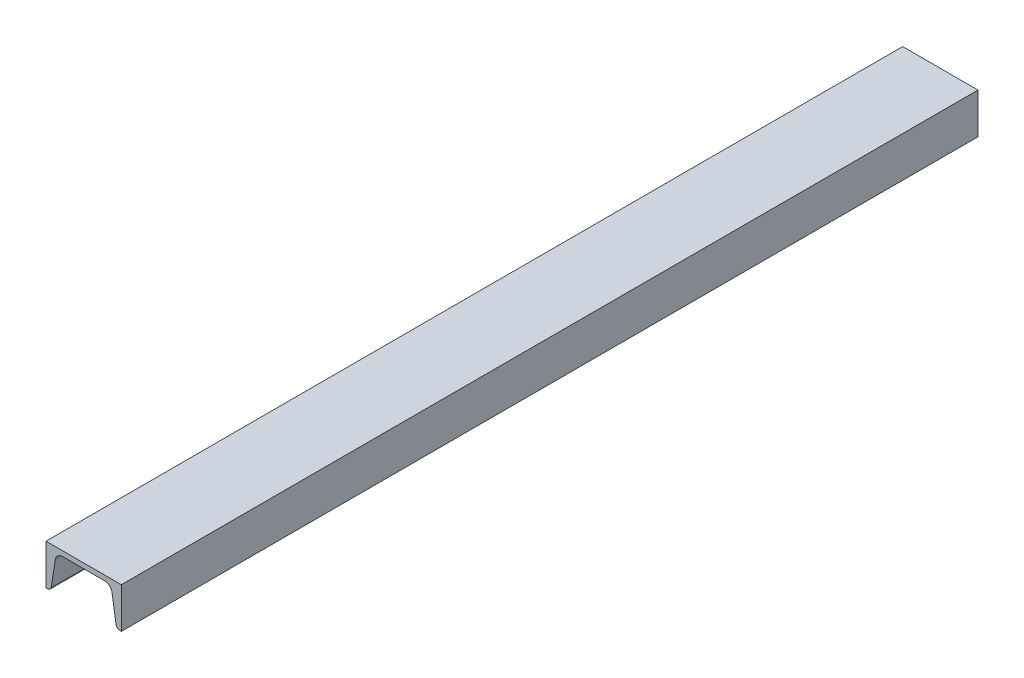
ISO-10303-21;
HEADER;
FILE_DESCRIPTION(('STEP AP214'),'2;1');
FILE_NAME('part.step','',(''),(''),'','','');
FILE_SCHEMA(('AUTOMOTIVE_DESIGN { 1 0 10303 214 1 1 1 1 }'));
ENDSEC;
DATA;
#1=APPLICATION_CONTEXT('core data for automotive mechanical design processes');
#2=APPLICATION_PROTOCOL_DEFINITION('international standard','automotive_design',2000,#1);
#3=PRODUCT_CONTEXT('',#1,'mechanical');
#4=PRODUCT('Part','Part','',(#3));
#5=PRODUCT_RELATED_PRODUCT_CATEGORY('part','',(#4));
#6=PRODUCT_DEFINITION_FORMATION('','',#4);
#7=PRODUCT_DEFINITION_CONTEXT('part definition',#1,'design');
#8=PRODUCT_DEFINITION('design','',#6,#7);
#9=PRODUCT_DEFINITION_SHAPE('','',#8);
#10=(LENGTH_UNIT() NAMED_UNIT(*) SI_UNIT(.MILLI.,.METRE.));
#11=(NAMED_UNIT(*) PLANE_ANGLE_UNIT() SI_UNIT($,.RADIAN.));
#12=(NAMED_UNIT(*) SI_UNIT($,.STERADIAN.) SOLID_ANGLE_UNIT());
#13=UNCERTAINTY_MEASURE_WITH_UNIT(LENGTH_MEASURE(1.E-05),#10,'distance_accuracy_value','');
#14=(GEOMETRIC_REPRESENTATION_CONTEXT(3) GLOBAL_UNCERTAINTY_ASSIGNED_CONTEXT((#13)) GLOBAL_UNIT_ASSIGNED_CONTEXT((#10,
#11,#12)) REPRESENTATION_CONTEXT('',''));
#15=CARTESIAN_POINT('',(0.,0.,0.));
#16=DIRECTION('',(0.,0.,1.));
#17=DIRECTION('',(1.,0.,0.));
#18=AXIS2_PLACEMENT_3D('',#15,#16,#17);
#19=CARTESIAN_POINT('',(-40.,-43.,910.));
#20=DIRECTION('',(1.,0.,0.));
#21=DIRECTION('',(0.,0.,-1.));
#22=AXIS2_PLACEMENT_3D('',#19,#20,#21);
#23=PLANE('',#22);
#24=DIRECTION('',(0.,-1.,0.));
#25=VECTOR('',#24,1.);
#26=CARTESIAN_POINT('',(-40.,-43.,0.));
#27=LINE('',#26,#25);
#28=CARTESIAN_POINT('',(-40.,0.,0.));
#29=VERTEX_POINT('',#28);
#30=CARTESIAN_POINT('',(-40.,-43.,0.));
#31=VERTEX_POINT('',#30);
#32=EDGE_CURVE('E133',#29,#31,#27,.T.);
#33=ORIENTED_EDGE('',*,*,#32,.T.);
#34=DIRECTION('',(0.,0.,-1.));
#35=VECTOR('',#34,1.);
#36=CARTESIAN_POINT('',(-40.,-43.,910.));
#37=LINE('',#36,#35);
#38=CARTESIAN_POINT('',(-40.,-43.,910.));
#39=VERTEX_POINT('',#38);
#40=EDGE_CURVE('E11',#39,#31,#37,.T.);
#41=ORIENTED_EDGE('',*,*,#40,.F.);
#42=DIRECTION('',(0.,-1.,0.));
#43=VECTOR('',#42,1.);
#44=CARTESIAN_POINT('',(-40.,-43.,910.));
#45=LINE('',#44,#43);
#46=CARTESIAN_POINT('',(-40.,0.,910.));
#47=VERTEX_POINT('',#46);
#48=EDGE_CURVE('E168',#47,#39,#45,.T.);
#49=ORIENTED_EDGE('',*,*,#48,.F.);
#50=DIRECTION('',(0.,0.,-1.));
#51=VECTOR('',#50,1.);
#52=CARTESIAN_POINT('',(-40.,0.,910.));
#53=LINE('',#52,#51);
#54=EDGE_CURVE('E146',#47,#29,#53,.T.);
#55=ORIENTED_EDGE('',*,*,#54,.T.);
#56=EDGE_LOOP('',(#33,#41,#49,#55));
#57=FACE_BOUND('',#56,.T.);
#58=ADVANCED_FACE('F41',(#57),#23,.F.);
#59=CARTESIAN_POINT('',(-38.4179755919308,-43.,910.));
#60=DIRECTION('',(0.,1.,0.));
#61=DIRECTION('',(0.,0.,1.));
#62=AXIS2_PLACEMENT_3D('',#59,#60,#61);
#63=PLANE('',#62);
#64=DIRECTION('',(1.,0.,0.));
#65=VECTOR('',#64,1.);
#66=CARTESIAN_POINT('',(-38.4179755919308,-43.,0.));
#67=LINE('',#66,#65);
#68=CARTESIAN_POINT('',(-38.4179755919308,-43.,0.));
#69=VERTEX_POINT('',#68);
#70=EDGE_CURVE('E129',#31,#69,#67,.T.);
#71=ORIENTED_EDGE('',*,*,#70,.T.);
#72=DIRECTION('',(0.,0.,-1.));
#73=VECTOR('',#72,1.);
#74=CARTESIAN_POINT('',(-38.4179755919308,-43.,910.));
#75=LINE('',#74,#73);
#76=CARTESIAN_POINT('',(-38.4179755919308,-43.,910.));
#77=VERTEX_POINT('',#76);
#78=EDGE_CURVE('E48',#77,#69,#75,.T.);
#79=ORIENTED_EDGE('',*,*,#78,.F.);
#80=DIRECTION('',(1.,0.,0.));
#81=VECTOR('',#80,1.);
#82=CARTESIAN_POINT('',(-38.4179755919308,-43.,910.));
#83=LINE('',#82,#81);
#84=EDGE_CURVE('E142',#39,#77,#83,.T.);
#85=ORIENTED_EDGE('',*,*,#84,.F.);
#86=ORIENTED_EDGE('',*,*,#40,.T.);
#87=EDGE_LOOP('',(#71,#79,#85,#86));
#88=FACE_BOUND('',#87,.T.);
#89=ADVANCED_FACE('F141',(#88),#63,.F.);
#90=CARTESIAN_POINT('',(-38.4179755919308,-39.,910.));
#91=DIRECTION('',(0.,0.,-1.));
#92=DIRECTION('',(-1.,0.,0.));
#93=AXIS2_PLACEMENT_3D('',#90,#91,#92);
#94=CYLINDRICAL_SURFACE('',#93,4.);
#95=CARTESIAN_POINT('',(-38.4179755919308,-39.,0.));
#96=DIRECTION('',(0.,0.,1.));
#97=DIRECTION('',(-1.,0.,0.));
#98=AXIS2_PLACEMENT_3D('',#95,#96,#97);
#99=CIRCLE('',#98,4.);
#100=CARTESIAN_POINT('',(-34.4669237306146,-39.623850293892,0.));
#101=VERTEX_POINT('',#100);
#102=EDGE_CURVE('E135',#69,#101,#99,.T.);
#103=ORIENTED_EDGE('',*,*,#102,.T.);
#104=DIRECTION('',(0.,0.,-1.));
#105=VECTOR('',#104,1.);
#106=CARTESIAN_POINT('',(-34.4669237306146,-39.623850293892,910.));
#107=LINE('',#106,#105);
#108=CARTESIAN_POINT('',(-34.4669237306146,-39.623850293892,910.));
#109=VERTEX_POINT('',#108);
#110=EDGE_CURVE('E214',#109,#101,#107,.T.);
#111=ORIENTED_EDGE('',*,*,#110,.F.);
#112=CARTESIAN_POINT('',(-38.4179755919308,-39.,910.));
#113=DIRECTION('',(0.,0.,1.));
#114=DIRECTION('',(-1.,0.,0.));
#115=AXIS2_PLACEMENT_3D('',#112,#113,#114);
#116=CIRCLE('',#115,4.);
#117=EDGE_CURVE('E171',#77,#109,#116,.T.);
#118=ORIENTED_EDGE('',*,*,#117,.F.);
#119=ORIENTED_EDGE('',*,*,#78,.T.);
#120=EDGE_LOOP('',(#103,#111,#118,#119));
#121=FACE_BOUND('',#120,.T.);
#122=ADVANCED_FACE('F218',(#121),#94,.T.);
#123=CARTESIAN_POINT('',(-30.1135209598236,-12.052299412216,910.));
#124=DIRECTION('',(-0.987762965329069,0.155962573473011,0.));
#125=DIRECTION('',(-0.155962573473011,-0.987762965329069,0.));
#126=AXIS2_PLACEMENT_3D('',#123,#124,#125);
#127=PLANE('',#126);
#128=DIRECTION('',(0.155962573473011,0.987762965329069,0.));
#129=VECTOR('',#128,1.);
#130=CARTESIAN_POINT('',(-30.1135209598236,-12.0522994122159,0.));
#131=LINE('',#130,#129);
#132=CARTESIAN_POINT('',(-30.1135209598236,-12.052299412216,0.));
#133=VERTEX_POINT('',#132);
#134=EDGE_CURVE('E150',#101,#133,#131,.T.);
#135=ORIENTED_EDGE('',*,*,#134,.T.);
#136=DIRECTION('',(0.,0.,-1.));
#137=VECTOR('',#136,1.);
#138=CARTESIAN_POINT('',(-30.1135209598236,-12.052299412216,910.));
#139=LINE('',#138,#137);
#140=CARTESIAN_POINT('',(-30.1135209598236,-12.052299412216,910.));
#141=VERTEX_POINT('',#140);
#142=EDGE_CURVE('E211',#141,#133,#139,.T.);
#143=ORIENTED_EDGE('',*,*,#142,.F.);
#144=DIRECTION('',(0.155962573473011,0.987762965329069,0.));
#145=VECTOR('',#144,1.);
#146=CARTESIAN_POINT('',(-30.1135209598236,-12.052299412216,910.));
#147=LINE('',#146,#145);
#148=EDGE_CURVE('E173',#109,#141,#147,.T.);
#149=ORIENTED_EDGE('',*,*,#148,.F.);
#150=ORIENTED_EDGE('',*,*,#110,.T.);
#151=EDGE_LOOP('',(#135,#143,#149,#150));
#152=FACE_BOUND('',#151,.T.);
#153=ADVANCED_FACE('F226',(#152),#127,.F.);
#154=CARTESIAN_POINT('',(-22.211417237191,-13.3,910.));
#155=DIRECTION('',(0.,0.,-1.));
#156=DIRECTION('',(-1.,0.,0.));
#157=AXIS2_PLACEMENT_3D('',#154,#155,#156);
#158=CYLINDRICAL_SURFACE('',#157,8.);
#159=CARTESIAN_POINT('',(-22.211417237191,-13.3,0.));
#160=DIRECTION('',(0.,0.,-1.));
#161=DIRECTION('',(1.,0.,0.));
#162=AXIS2_PLACEMENT_3D('',#159,#160,#161);
#163=CIRCLE('',#162,8.);
#164=CARTESIAN_POINT('',(-22.211417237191,-5.3,0.));
#165=VERTEX_POINT('',#164);
#166=EDGE_CURVE('E152',#133,#165,#163,.T.);
#167=ORIENTED_EDGE('',*,*,#166,.T.);
#168=DIRECTION('',(0.,0.,-1.));
#169=VECTOR('',#168,1.);
#170=CARTESIAN_POINT('',(-22.211417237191,-5.3,910.));
#171=LINE('',#170,#169);
#172=CARTESIAN_POINT('',(-22.211417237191,-5.3,910.));
#173=VERTEX_POINT('',#172);
#174=EDGE_CURVE('E208',#173,#165,#171,.T.);
#175=ORIENTED_EDGE('',*,*,#174,.F.);
#176=CARTESIAN_POINT('',(-22.211417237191,-13.3,910.));
#177=DIRECTION('',(0.,0.,-1.));
#178=DIRECTION('',(1.,0.,0.));
#179=AXIS2_PLACEMENT_3D('',#176,#177,#178);
#180=CIRCLE('',#179,8.);
#181=EDGE_CURVE('E175',#141,#173,#180,.T.);
#182=ORIENTED_EDGE('',*,*,#181,.F.);
#183=ORIENTED_EDGE('',*,*,#142,.T.);
#184=EDGE_LOOP('',(#167,#175,#182,#183));
#185=FACE_BOUND('',#184,.T.);
#186=ADVANCED_FACE('F229',(#185),#158,.F.);
#187=CARTESIAN_POINT('',(22.211417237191,-5.3,910.));
#188=DIRECTION('',(0.,1.,0.));
#189=DIRECTION('',(-1.,0.,0.));
#190=AXIS2_PLACEMENT_3D('',#187,#188,#189);
#191=PLANE('',#190);
#192=DIRECTION('',(1.,0.,0.));
#193=VECTOR('',#192,1.);
#194=CARTESIAN_POINT('',(22.211417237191,-5.3,0.));
#195=LINE('',#194,#193);
#196=CARTESIAN_POINT('',(22.211417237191,-5.3,0.));
#197=VERTEX_POINT('',#196);
#198=EDGE_CURVE('E154',#165,#197,#195,.T.);
#199=ORIENTED_EDGE('',*,*,#198,.T.);
#200=DIRECTION('',(0.,0.,-1.));
#201=VECTOR('',#200,1.);
#202=CARTESIAN_POINT('',(22.211417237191,-5.3,910.));
#203=LINE('',#202,#201);
#204=CARTESIAN_POINT('',(22.211417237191,-5.3,910.));
#205=VERTEX_POINT('',#204);
#206=EDGE_CURVE('E205',#205,#197,#203,.T.);
#207=ORIENTED_EDGE('',*,*,#206,.F.);
#208=DIRECTION('',(1.,0.,0.));
#209=VECTOR('',#208,1.);
#210=CARTESIAN_POINT('',(22.211417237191,-5.3,910.));
#211=LINE('',#210,#209);
#212=EDGE_CURVE('E177',#173,#205,#211,.T.);
#213=ORIENTED_EDGE('',*,*,#212,.F.);
#214=ORIENTED_EDGE('',*,*,#174,.T.);
#215=EDGE_LOOP('',(#199,#207,#213,#214));
#216=FACE_BOUND('',#215,.T.);
#217=ADVANCED_FACE('F234',(#216),#191,.F.);
#218=CARTESIAN_POINT('',(22.211417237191,-13.3,910.));
#219=DIRECTION('',(0.,0.,-1.));
#220=DIRECTION('',(-1.,0.,0.));
#221=AXIS2_PLACEMENT_3D('',#218,#219,#220);
#222=CYLINDRICAL_SURFACE('',#221,8.);
#223=CARTESIAN_POINT('',(22.211417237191,-13.3,0.));
#224=DIRECTION('',(0.,0.,-1.));
#225=DIRECTION('',(1.,0.,0.));
#226=AXIS2_PLACEMENT_3D('',#223,#224,#225);
#227=CIRCLE('',#226,8.);
#228=CARTESIAN_POINT('',(30.1135209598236,-12.052299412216,0.));
#229=VERTEX_POINT('',#228);
#230=EDGE_CURVE('E156',#197,#229,#227,.T.);
#231=ORIENTED_EDGE('',*,*,#230,.T.);
#232=DIRECTION('',(0.,0.,-1.));
#233=VECTOR('',#232,1.);
#234=CARTESIAN_POINT('',(30.1135209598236,-12.052299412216,910.));
#235=LINE('',#234,#233);
#236=CARTESIAN_POINT('',(30.1135209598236,-12.052299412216,910.));
#237=VERTEX_POINT('',#236);
#238=EDGE_CURVE('E202',#237,#229,#235,.T.);
#239=ORIENTED_EDGE('',*,*,#238,.F.);
#240=CARTESIAN_POINT('',(22.211417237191,-13.3,910.));
#241=DIRECTION('',(0.,0.,-1.));
#242=DIRECTION('',(1.,0.,0.));
#243=AXIS2_PLACEMENT_3D('',#240,#241,#242);
#244=CIRCLE('',#243,8.);
#245=EDGE_CURVE('E179',#205,#237,#244,.T.);
#246=ORIENTED_EDGE('',*,*,#245,.F.);
#247=ORIENTED_EDGE('',*,*,#206,.T.);
#248=EDGE_LOOP('',(#231,#239,#246,#247));
#249=FACE_BOUND('',#248,.T.);
#250=ADVANCED_FACE('F240',(#249),#222,.F.);
#251=CARTESIAN_POINT('',(30.1135209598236,-12.052299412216,910.));
#252=DIRECTION('',(0.987762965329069,0.155962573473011,0.));
#253=DIRECTION('',(-0.155962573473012,0.987762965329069,0.));
#254=AXIS2_PLACEMENT_3D('',#251,#252,#253);
#255=PLANE('',#254);
#256=DIRECTION('',(0.155962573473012,-0.987762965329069,0.));
#257=VECTOR('',#256,1.);
#258=CARTESIAN_POINT('',(30.1135209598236,-12.052299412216,0.));
#259=LINE('',#258,#257);
#260=CARTESIAN_POINT('',(34.4669237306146,-39.623850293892,0.));
#261=VERTEX_POINT('',#260);
#262=EDGE_CURVE('E158',#229,#261,#259,.T.);
#263=ORIENTED_EDGE('',*,*,#262,.T.);
#264=DIRECTION('',(0.,0.,-1.));
#265=VECTOR('',#264,1.);
#266=CARTESIAN_POINT('',(34.4669237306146,-39.623850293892,910.));
#267=LINE('',#266,#265);
#268=CARTESIAN_POINT('',(34.4669237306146,-39.623850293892,910.));
#269=VERTEX_POINT('',#268);
#270=EDGE_CURVE('E199',#269,#261,#267,.T.);
#271=ORIENTED_EDGE('',*,*,#270,.F.);
#272=DIRECTION('',(0.155962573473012,-0.987762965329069,0.));
#273=VECTOR('',#272,1.);
#274=CARTESIAN_POINT('',(30.1135209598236,-12.052299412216,910.));
#275=LINE('',#274,#273);
#276=EDGE_CURVE('E181',#237,#269,#275,.T.);
#277=ORIENTED_EDGE('',*,*,#276,.F.);
#278=ORIENTED_EDGE('',*,*,#238,.T.);
#279=EDGE_LOOP('',(#263,#271,#277,#278));
#280=FACE_BOUND('',#279,.T.);
#281=ADVANCED_FACE('F244',(#280),#255,.F.);
#282=CARTESIAN_POINT('',(38.4179755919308,-39.,910.));
#283=DIRECTION('',(0.,0.,-1.));
#284=DIRECTION('',(-1.,0.,0.));
#285=AXIS2_PLACEMENT_3D('',#282,#283,#284);
#286=CYLINDRICAL_SURFACE('',#285,4.);
#287=CARTESIAN_POINT('',(38.4179755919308,-39.,0.));
#288=DIRECTION('',(0.,0.,1.));
#289=DIRECTION('',(-1.,0.,0.));
#290=AXIS2_PLACEMENT_3D('',#287,#288,#289);
#291=CIRCLE('',#290,4.);
#292=CARTESIAN_POINT('',(38.4179755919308,-43.,0.));
#293=VERTEX_POINT('',#292);
#294=EDGE_CURVE('E160',#261,#293,#291,.T.);
#295=ORIENTED_EDGE('',*,*,#294,.T.);
#296=DIRECTION('',(0.,0.,-1.));
#297=VECTOR('',#296,1.);
#298=CARTESIAN_POINT('',(38.4179755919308,-43.,910.));
#299=LINE('',#298,#297);
#300=CARTESIAN_POINT('',(38.4179755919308,-43.,910.));
#301=VERTEX_POINT('',#300);
#302=EDGE_CURVE('E196',#301,#293,#299,.T.);
#303=ORIENTED_EDGE('',*,*,#302,.F.);
#304=CARTESIAN_POINT('',(38.4179755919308,-39.,910.));
#305=DIRECTION('',(0.,0.,1.));
#306=DIRECTION('',(-1.,0.,0.));
#307=AXIS2_PLACEMENT_3D('',#304,#305,#306);
#308=CIRCLE('',#307,4.);
#309=EDGE_CURVE('E183',#269,#301,#308,.T.);
#310=ORIENTED_EDGE('',*,*,#309,.F.);
#311=ORIENTED_EDGE('',*,*,#270,.T.);
#312=EDGE_LOOP('',(#295,#303,#310,#311));
#313=FACE_BOUND('',#312,.T.);
#314=ADVANCED_FACE('F249',(#313),#286,.T.);
#315=CARTESIAN_POINT('',(40.,-43.,910.));
#316=DIRECTION('',(0.,1.,0.));
#317=DIRECTION('',(0.,0.,1.));
#318=AXIS2_PLACEMENT_3D('',#315,#316,#317);
#319=PLANE('',#318);
#320=DIRECTION('',(1.,0.,0.));
#321=VECTOR('',#320,1.);
#322=CARTESIAN_POINT('',(40.,-43.,0.));
#323=LINE('',#322,#321);
#324=CARTESIAN_POINT('',(40.,-43.,0.));
#325=VERTEX_POINT('',#324);
#326=EDGE_CURVE('E162',#293,#325,#323,.T.);
#327=ORIENTED_EDGE('',*,*,#326,.T.);
#328=DIRECTION('',(0.,0.,-1.));
#329=VECTOR('',#328,1.);
#330=CARTESIAN_POINT('',(40.,-43.,910.));
#331=LINE('',#330,#329);
#332=CARTESIAN_POINT('',(40.,-43.,910.));
#333=VERTEX_POINT('',#332);
#334=EDGE_CURVE('E193',#333,#325,#331,.T.);
#335=ORIENTED_EDGE('',*,*,#334,.F.);
#336=DIRECTION('',(1.,0.,0.));
#337=VECTOR('',#336,1.);
#338=CARTESIAN_POINT('',(40.,-43.,910.));
#339=LINE('',#338,#337);
#340=EDGE_CURVE('E185',#301,#333,#339,.T.);
#341=ORIENTED_EDGE('',*,*,#340,.F.);
#342=ORIENTED_EDGE('',*,*,#302,.T.);
#343=EDGE_LOOP('',(#327,#335,#341,#342));
#344=FACE_BOUND('',#343,.T.);
#345=ADVANCED_FACE('F253',(#344),#319,.F.);
#346=CARTESIAN_POINT('',(40.,0.,910.));
#347=DIRECTION('',(-1.,0.,0.));
#348=DIRECTION('',(0.,-1.,0.));
#349=AXIS2_PLACEMENT_3D('',#346,#347,#348);
#350=PLANE('',#349);
#351=DIRECTION('',(0.,1.,0.));
#352=VECTOR('',#351,1.);
#353=CARTESIAN_POINT('',(40.,0.,0.));
#354=LINE('',#353,#352);
#355=CARTESIAN_POINT('',(40.,0.,0.));
#356=VERTEX_POINT('',#355);
#357=EDGE_CURVE('E164',#325,#356,#354,.T.);
#358=ORIENTED_EDGE('',*,*,#357,.T.);
#359=DIRECTION('',(0.,0.,-1.));
#360=VECTOR('',#359,1.);
#361=CARTESIAN_POINT('',(40.,0.,910.));
#362=LINE('',#361,#360);
#363=CARTESIAN_POINT('',(40.,0.,910.));
#364=VERTEX_POINT('',#363);
#365=EDGE_CURVE('E190',#364,#356,#362,.T.);
#366=ORIENTED_EDGE('',*,*,#365,.F.);
#367=DIRECTION('',(0.,1.,0.));
#368=VECTOR('',#367,1.);
#369=CARTESIAN_POINT('',(40.,0.,910.));
#370=LINE('',#369,#368);
#371=EDGE_CURVE('E60',#333,#364,#370,.T.);
#372=ORIENTED_EDGE('',*,*,#371,.F.);
#373=ORIENTED_EDGE('',*,*,#334,.T.);
#374=EDGE_LOOP('',(#358,#366,#372,#373));
#375=FACE_BOUND('',#374,.T.);
#376=ADVANCED_FACE('F257',(#375),#350,.F.);
#377=CARTESIAN_POINT('',(-40.,0.,910.));
#378=DIRECTION('',(0.,-1.,0.));
#379=DIRECTION('',(0.,0.,-1.));
#380=AXIS2_PLACEMENT_3D('',#377,#378,#379);
#381=PLANE('',#380);
#382=DIRECTION('',(-1.,0.,0.));
#383=VECTOR('',#382,1.);
#384=CARTESIAN_POINT('',(-40.,0.,0.));
#385=LINE('',#384,#383);
#386=EDGE_CURVE('E166',#356,#29,#385,.T.);
#387=ORIENTED_EDGE('',*,*,#386,.T.);
#388=ORIENTED_EDGE('',*,*,#54,.F.);
#389=DIRECTION('',(-1.,0.,0.));
#390=VECTOR('',#389,1.);
#391=CARTESIAN_POINT('',(-40.,0.,910.));
#392=LINE('',#391,#390);
#393=EDGE_CURVE('E55',#364,#47,#392,.T.);
#394=ORIENTED_EDGE('',*,*,#393,.F.);
#395=ORIENTED_EDGE('',*,*,#365,.T.);
#396=EDGE_LOOP('',(#387,#388,#394,#395));
#397=FACE_BOUND('',#396,.T.);
#398=ADVANCED_FACE('F259',(#397),#381,.F.);
#399=CARTESIAN_POINT('',(38.4179755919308,-39.,910.));
#400=DIRECTION('',(0.,0.,-1.));
#401=DIRECTION('',(-1.,0.,0.));
#402=AXIS2_PLACEMENT_3D('',#399,#400,#401);
#403=PLANE('',#402);
#404=ORIENTED_EDGE('',*,*,#48,.T.);
#405=ORIENTED_EDGE('',*,*,#84,.T.);
#406=ORIENTED_EDGE('',*,*,#117,.T.);
#407=ORIENTED_EDGE('',*,*,#148,.T.);
#408=ORIENTED_EDGE('',*,*,#181,.T.);
#409=ORIENTED_EDGE('',*,*,#212,.T.);
#410=ORIENTED_EDGE('',*,*,#245,.T.);
#411=ORIENTED_EDGE('',*,*,#276,.T.);
#412=ORIENTED_EDGE('',*,*,#309,.T.);
#413=ORIENTED_EDGE('',*,*,#340,.T.);
#414=ORIENTED_EDGE('',*,*,#371,.T.);
#415=ORIENTED_EDGE('',*,*,#393,.T.);
#416=EDGE_LOOP('',(#404,#405,#406,#407,#408,#409,#410,#411,#412,#413,#414,#415));
#417=FACE_BOUND('',#416,.T.);
#418=ADVANCED_FACE('F221',(#417),#403,.F.);
#419=CARTESIAN_POINT('',(38.4179755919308,-39.,0.));
#420=DIRECTION('',(0.,0.,-1.));
#421=DIRECTION('',(-1.,0.,0.));
#422=AXIS2_PLACEMENT_3D('',#419,#420,#421);
#423=PLANE('',#422);
#424=ORIENTED_EDGE('',*,*,#32,.F.);
#425=ORIENTED_EDGE('',*,*,#386,.F.);
#426=ORIENTED_EDGE('',*,*,#357,.F.);
#427=ORIENTED_EDGE('',*,*,#326,.F.);
#428=ORIENTED_EDGE('',*,*,#294,.F.);
#429=ORIENTED_EDGE('',*,*,#262,.F.);
#430=ORIENTED_EDGE('',*,*,#230,.F.);
#431=ORIENTED_EDGE('',*,*,#198,.F.);
#432=ORIENTED_EDGE('',*,*,#166,.F.);
#433=ORIENTED_EDGE('',*,*,#134,.F.);
#434=ORIENTED_EDGE('',*,*,#102,.F.);
#435=ORIENTED_EDGE('',*,*,#70,.F.);
#436=EDGE_LOOP('',(#424,#425,#426,#427,#428,#429,#430,#431,#432,#433,#434,#435));
#437=FACE_BOUND('',#436,.T.);
#438=ADVANCED_FACE('F130',(#437),#423,.T.);
#439=CLOSED_SHELL('',(#58,#89,#122,#153,#186,#217,#250,#281,#314,#345,#376,#398,#418,#438));
#440=MANIFOLD_SOLID_BREP('B2',#439);
#441=ADVANCED_BREP_SHAPE_REPRESENTATION('',(#18,#440),#14);
#442=SHAPE_DEFINITION_REPRESENTATION(#9,#441);
ENDSEC;
END-ISO-10303-21;
